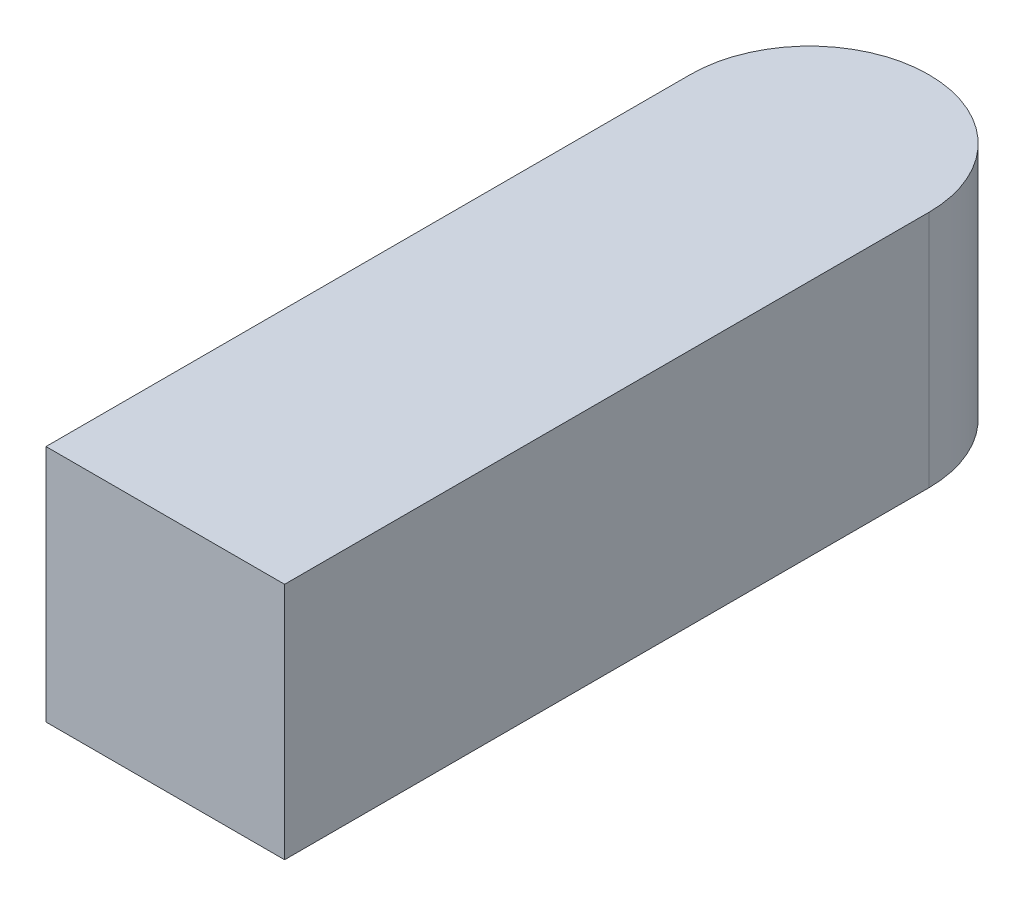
ISO-10303-21;
HEADER;
FILE_DESCRIPTION(('STEP AP214'),'2;1');
FILE_NAME('part.step','',(''),(''),'','','');
FILE_SCHEMA(('AUTOMOTIVE_DESIGN { 1 0 10303 214 1 1 1 1 }'));
ENDSEC;
DATA;
#1=APPLICATION_CONTEXT('core data for automotive mechanical design processes');
#2=APPLICATION_PROTOCOL_DEFINITION('international standard','automotive_design',2000,#1);
#3=PRODUCT_CONTEXT('',#1,'mechanical');
#4=PRODUCT('Part','Part','',(#3));
#5=PRODUCT_RELATED_PRODUCT_CATEGORY('part','',(#4));
#6=PRODUCT_DEFINITION_FORMATION('','',#4);
#7=PRODUCT_DEFINITION_CONTEXT('part definition',#1,'design');
#8=PRODUCT_DEFINITION('design','',#6,#7);
#9=PRODUCT_DEFINITION_SHAPE('','',#8);
#10=(LENGTH_UNIT() NAMED_UNIT(*) SI_UNIT(.MILLI.,.METRE.));
#11=(NAMED_UNIT(*) PLANE_ANGLE_UNIT() SI_UNIT($,.RADIAN.));
#12=(NAMED_UNIT(*) SI_UNIT($,.STERADIAN.) SOLID_ANGLE_UNIT());
#13=UNCERTAINTY_MEASURE_WITH_UNIT(LENGTH_MEASURE(1.E-05),#10,'distance_accuracy_value','');
#14=(GEOMETRIC_REPRESENTATION_CONTEXT(3) GLOBAL_UNCERTAINTY_ASSIGNED_CONTEXT((#13)) GLOBAL_UNIT_ASSIGNED_CONTEXT((#10,
#11,#12)) REPRESENTATION_CONTEXT('',''));
#15=CARTESIAN_POINT('',(0.,0.,0.));
#16=DIRECTION('',(0.,0.,1.));
#17=DIRECTION('',(1.,0.,0.));
#18=AXIS2_PLACEMENT_3D('',#15,#16,#17);
#19=CARTESIAN_POINT('',(0.,0.,16.));
#20=DIRECTION('',(1.,0.,0.));
#21=DIRECTION('',(0.,0.,-1.));
#22=AXIS2_PLACEMENT_3D('',#19,#20,#21);
#23=PLANE('',#22);
#24=DIRECTION('',(0.,0.,-1.));
#25=VECTOR('',#24,1.);
#26=CARTESIAN_POINT('',(0.,5.,16.));
#27=LINE('',#26,#25);
#28=CARTESIAN_POINT('',(0.,5.,16.));
#29=VERTEX_POINT('',#28);
#30=CARTESIAN_POINT('',(0.,5.,2.5));
#31=VERTEX_POINT('',#30);
#32=EDGE_CURVE('E112',#29,#31,#27,.T.);
#33=ORIENTED_EDGE('',*,*,#32,.T.);
#34=DIRECTION('',(0.,-1.,0.));
#35=VECTOR('',#34,1.);
#36=CARTESIAN_POINT('',(0.,0.,2.5));
#37=LINE('',#36,#35);
#38=CARTESIAN_POINT('',(0.,0.,2.5));
#39=VERTEX_POINT('',#38);
#40=EDGE_CURVE('E99',#31,#39,#37,.T.);
#41=ORIENTED_EDGE('',*,*,#40,.T.);
#42=DIRECTION('',(0.,0.,-1.));
#43=VECTOR('',#42,1.);
#44=CARTESIAN_POINT('',(0.,0.,16.));
#45=LINE('',#44,#43);
#46=CARTESIAN_POINT('',(0.,0.,16.));
#47=VERTEX_POINT('',#46);
#48=EDGE_CURVE('E81',#47,#39,#45,.T.);
#49=ORIENTED_EDGE('',*,*,#48,.F.);
#50=DIRECTION('',(0.,-1.,0.));
#51=VECTOR('',#50,1.);
#52=CARTESIAN_POINT('',(0.,0.,16.));
#53=LINE('',#52,#51);
#54=EDGE_CURVE('E86',#29,#47,#53,.T.);
#55=ORIENTED_EDGE('',*,*,#54,.F.);
#56=EDGE_LOOP('',(#33,#41,#49,#55));
#57=FACE_BOUND('',#56,.T.);
#58=ADVANCED_FACE('F31',(#57),#23,.F.);
#59=CARTESIAN_POINT('',(0.,0.,16.));
#60=DIRECTION('',(0.,1.,0.));
#61=DIRECTION('',(0.,0.,1.));
#62=AXIS2_PLACEMENT_3D('',#59,#60,#61);
#63=PLANE('',#62);
#64=ORIENTED_EDGE('',*,*,#48,.T.);
#65=CARTESIAN_POINT('',(2.5,0.,2.5));
#66=DIRECTION('',(0.,1.,0.));
#67=DIRECTION('',(0.,0.,1.));
#68=AXIS2_PLACEMENT_3D('',#65,#66,#67);
#69=CIRCLE('',#68,2.5);
#70=CARTESIAN_POINT('',(2.5,0.,0.));
#71=VERTEX_POINT('',#70);
#72=EDGE_CURVE('E108',#39,#71,#69,.F.);
#73=ORIENTED_EDGE('',*,*,#72,.T.);
#74=CARTESIAN_POINT('',(2.5,0.,2.5));
#75=DIRECTION('',(0.,1.,0.));
#76=DIRECTION('',(0.,0.,1.));
#77=AXIS2_PLACEMENT_3D('',#74,#75,#76);
#78=CIRCLE('',#77,2.5);
#79=CARTESIAN_POINT('',(5.,0.,2.5));
#80=VERTEX_POINT('',#79);
#81=EDGE_CURVE('E101',#71,#80,#78,.F.);
#82=ORIENTED_EDGE('',*,*,#81,.T.);
#83=DIRECTION('',(0.,0.,-1.));
#84=VECTOR('',#83,1.);
#85=CARTESIAN_POINT('',(5.,0.,16.));
#86=LINE('',#85,#84);
#87=CARTESIAN_POINT('',(5.,0.,16.));
#88=VERTEX_POINT('',#87);
#89=EDGE_CURVE('E82',#88,#80,#86,.T.);
#90=ORIENTED_EDGE('',*,*,#89,.F.);
#91=DIRECTION('',(1.,0.,0.));
#92=VECTOR('',#91,1.);
#93=CARTESIAN_POINT('',(0.,0.,16.));
#94=LINE('',#93,#92);
#95=EDGE_CURVE('E77',#47,#88,#94,.T.);
#96=ORIENTED_EDGE('',*,*,#95,.F.);
#97=EDGE_LOOP('',(#64,#73,#82,#90,#96));
#98=FACE_BOUND('',#97,.T.);
#99=ADVANCED_FACE('F79',(#98),#63,.F.);
#100=CARTESIAN_POINT('',(5.,0.,16.));
#101=DIRECTION('',(-1.,0.,0.));
#102=DIRECTION('',(0.,-1.,0.));
#103=AXIS2_PLACEMENT_3D('',#100,#101,#102);
#104=PLANE('',#103);
#105=ORIENTED_EDGE('',*,*,#89,.T.);
#106=DIRECTION('',(0.,1.,0.));
#107=VECTOR('',#106,1.);
#108=CARTESIAN_POINT('',(5.,5.,2.5));
#109=LINE('',#108,#107);
#110=CARTESIAN_POINT('',(5.,5.,2.5));
#111=VERTEX_POINT('',#110);
#112=EDGE_CURVE('E11',#80,#111,#109,.T.);
#113=ORIENTED_EDGE('',*,*,#112,.T.);
#114=DIRECTION('',(0.,0.,-1.));
#115=VECTOR('',#114,1.);
#116=CARTESIAN_POINT('',(5.,5.,16.));
#117=LINE('',#116,#115);
#118=CARTESIAN_POINT('',(5.,5.,16.));
#119=VERTEX_POINT('',#118);
#120=EDGE_CURVE('E103',#119,#111,#117,.T.);
#121=ORIENTED_EDGE('',*,*,#120,.F.);
#122=DIRECTION('',(0.,1.,0.));
#123=VECTOR('',#122,1.);
#124=CARTESIAN_POINT('',(5.,0.,16.));
#125=LINE('',#124,#123);
#126=EDGE_CURVE('E85',#88,#119,#125,.T.);
#127=ORIENTED_EDGE('',*,*,#126,.F.);
#128=EDGE_LOOP('',(#105,#113,#121,#127));
#129=FACE_BOUND('',#128,.T.);
#130=ADVANCED_FACE('F123',(#129),#104,.F.);
#131=CARTESIAN_POINT('',(0.,5.,16.));
#132=DIRECTION('',(0.,-1.,0.));
#133=DIRECTION('',(0.,0.,-1.));
#134=AXIS2_PLACEMENT_3D('',#131,#132,#133);
#135=PLANE('',#134);
#136=CARTESIAN_POINT('',(2.5,5.,2.5));
#137=DIRECTION('',(0.,-1.,0.));
#138=DIRECTION('',(0.,0.,-1.));
#139=AXIS2_PLACEMENT_3D('',#136,#137,#138);
#140=CIRCLE('',#139,2.5);
#141=CARTESIAN_POINT('',(2.5,5.,0.));
#142=VERTEX_POINT('',#141);
#143=EDGE_CURVE('E50',#111,#142,#140,.F.);
#144=ORIENTED_EDGE('',*,*,#143,.T.);
#145=CARTESIAN_POINT('',(2.5,5.,2.5));
#146=DIRECTION('',(0.,-1.,0.));
#147=DIRECTION('',(0.,0.,-1.));
#148=AXIS2_PLACEMENT_3D('',#145,#146,#147);
#149=CIRCLE('',#148,2.5);
#150=EDGE_CURVE('E38',#142,#31,#149,.F.);
#151=ORIENTED_EDGE('',*,*,#150,.T.);
#152=ORIENTED_EDGE('',*,*,#32,.F.);
#153=DIRECTION('',(-1.,0.,0.));
#154=VECTOR('',#153,1.);
#155=CARTESIAN_POINT('',(0.,5.,16.));
#156=LINE('',#155,#154);
#157=EDGE_CURVE('E91',#119,#29,#156,.T.);
#158=ORIENTED_EDGE('',*,*,#157,.F.);
#159=ORIENTED_EDGE('',*,*,#120,.T.);
#160=EDGE_LOOP('',(#144,#151,#152,#158,#159));
#161=FACE_BOUND('',#160,.T.);
#162=ADVANCED_FACE('F111',(#161),#135,.F.);
#163=CARTESIAN_POINT('',(0.,5.,16.));
#164=DIRECTION('',(0.,0.,-1.));
#165=DIRECTION('',(-1.,0.,0.));
#166=AXIS2_PLACEMENT_3D('',#163,#164,#165);
#167=PLANE('',#166);
#168=ORIENTED_EDGE('',*,*,#54,.T.);
#169=ORIENTED_EDGE('',*,*,#95,.T.);
#170=ORIENTED_EDGE('',*,*,#126,.T.);
#171=ORIENTED_EDGE('',*,*,#157,.T.);
#172=EDGE_LOOP('',(#168,#169,#170,#171));
#173=FACE_BOUND('',#172,.T.);
#174=ADVANCED_FACE('F89',(#173),#167,.F.);
#175=CARTESIAN_POINT('',(2.5,0.,2.5));
#176=DIRECTION('',(0.,-1.,0.));
#177=DIRECTION('',(1.,0.,0.));
#178=AXIS2_PLACEMENT_3D('',#175,#176,#177);
#179=CYLINDRICAL_SURFACE('',#178,2.5);
#180=DIRECTION('',(0.,1.,0.));
#181=VECTOR('',#180,1.);
#182=CARTESIAN_POINT('',(2.5,0.,0.));
#183=LINE('',#182,#181);
#184=EDGE_CURVE('E95',#142,#71,#183,.F.);
#185=ORIENTED_EDGE('',*,*,#184,.F.);
#186=ORIENTED_EDGE('',*,*,#143,.F.);
#187=ORIENTED_EDGE('',*,*,#112,.F.);
#188=ORIENTED_EDGE('',*,*,#81,.F.);
#189=EDGE_LOOP('',(#185,#186,#187,#188));
#190=FACE_BOUND('',#189,.T.);
#191=ADVANCED_FACE('F119',(#190),#179,.T.);
#192=CARTESIAN_POINT('',(2.5,0.,2.5));
#193=DIRECTION('',(0.,1.,0.));
#194=DIRECTION('',(0.,0.,1.));
#195=AXIS2_PLACEMENT_3D('',#192,#193,#194);
#196=CYLINDRICAL_SURFACE('',#195,2.5);
#197=ORIENTED_EDGE('',*,*,#150,.F.);
#198=ORIENTED_EDGE('',*,*,#184,.T.);
#199=ORIENTED_EDGE('',*,*,#72,.F.);
#200=ORIENTED_EDGE('',*,*,#40,.F.);
#201=EDGE_LOOP('',(#197,#198,#199,#200));
#202=FACE_BOUND('',#201,.T.);
#203=ADVANCED_FACE('F116',(#202),#196,.T.);
#204=CLOSED_SHELL('',(#58,#99,#130,#162,#174,#191,#203));
#205=MANIFOLD_SOLID_BREP('B2',#204);
#206=ADVANCED_BREP_SHAPE_REPRESENTATION('',(#18,#205),#14);
#207=SHAPE_DEFINITION_REPRESENTATION(#9,#206);
ENDSEC;
END-ISO-10303-21;
